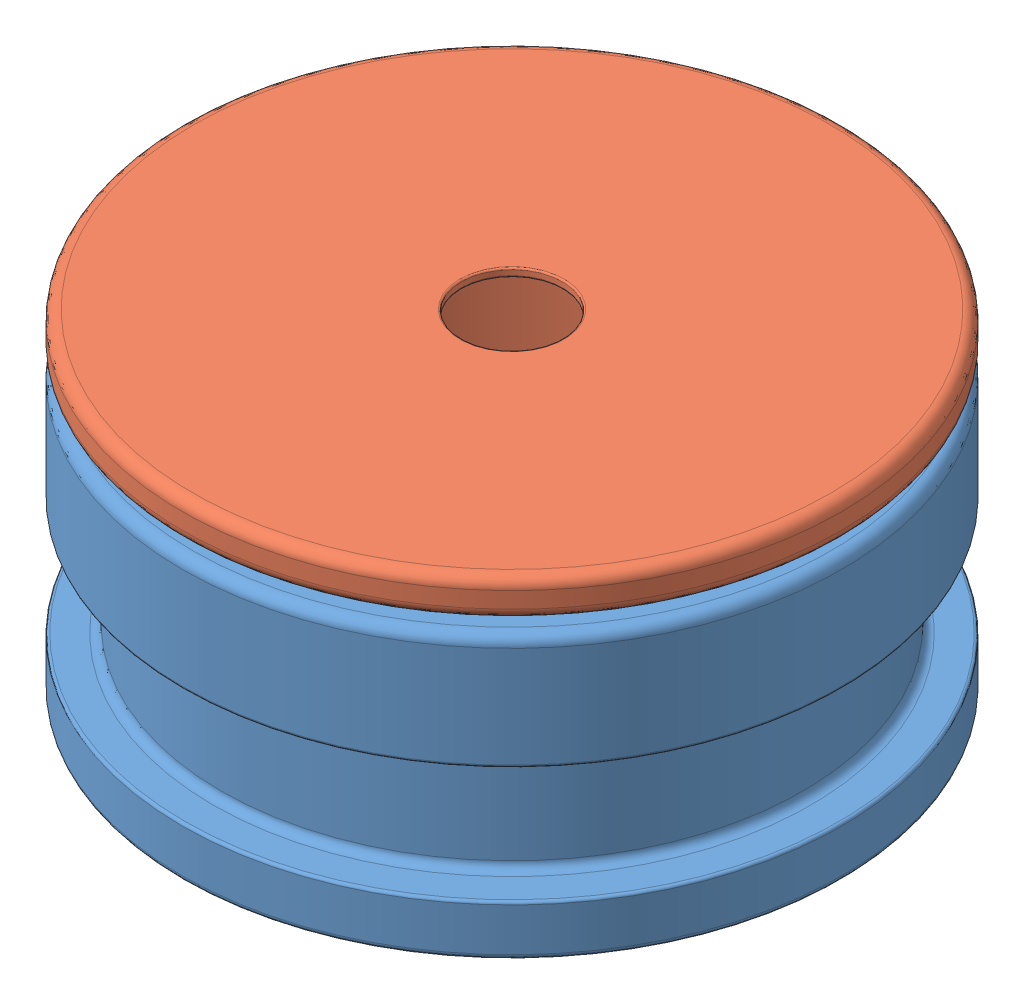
SolidWorks assembly SH1.SLDASM, configuration Default (file format 4400). Lengths in mm.
Overall size (35.54 15.65 35.54).
6 component instances, 6 part files, 9 mates.
Components (placement in the parent):
- SH1 Bottom-1: SH1 Bottom.SLDPRT [Default] at origin size (31.12 13.28 31.12)
- SH1 Top-1: SH1 Top.SLDPRT [Default] at (0 2.3622 0) size (31.12 13.08 31.12)
- 1002432-001-1: 1002432-001.SLDPRT [Default] at (0 -11.1498 0) x (0.73007 0 -0.683372) z (0 1 0) size (25.15 25.15 0.38)
- 25 mm filter-1: 25 mm filter.SLDPRT [Default] at (0 -10.7688 0) x (0.981263 0 0.192671) z (0 1 0) size (25 25 0.05)
- 021oring-4: 021oring.SLDPRT [PreviewCfg] at (0 -2.7432 0) size (28.19 1.78 28.19)
- 020oring-3: 020oring.SLDPRT [PreviewCfg] at (0 -7.0192 0) x (0.863465 0 -0.504409) z (0.504409 0 0.863465) size (25.78 1.78 25.78)
Mates (geometry in assembly coordinates):
- Concentric1: concentric aligned: cylinder of SH1 Bottom-1 through (0 0 0) axis (0 1 0) radius 15.5575; cylinder of SH1 Top-1 through (0 2.3622 0) axis (0 1 0) radius 15.5575
- Distance1: distance = 0.5842 mm anti-aligned: plane of SH1 Bottom-1 through (-14.138 0 0) normal (0 1 0); plane of SH1 Top-1 through (-15.0495 0.5842 0) normal (0 -1 0)
- Coincident1: coincident anti-aligned: plane of 1002432-001-1 through (-0.5931 -10.7688 17.9507) normal (0 1 0); plane of 25 mm filter-1 through (0 -10.7688 0) normal (0 -1 0)
- Concentric2: concentric aligned: cylinder of 1002432-001-1 through (0 -10.7688 0) axis (0 -1 0) radius 12.573; cylinder of 25 mm filter-1 through (0 -10.7188 0) axis (0 -1 0) radius 12.5
- Concentric3: concentric anti-aligned: cylinder of SH1 Bottom-1 through (0 0 0) axis (0 1 0) radius 12.7; cylinder of 1002432-001-1 through (0 -10.7688 0) axis (0 -1 0) radius 12.573
- Coincident2: coincident anti-aligned: plane of SH1 Top-1 through (-12.4206 -10.7188 0) normal (0 -1 0); plane of 25 mm filter-1 through (0 -10.7188 0) normal (0 1 0)
- Concentric4: concentric anti-aligned: cylinder of SH1 Top-1 through (0 2.3622 0) axis (0 1 0) radius 10.541; axis of 021oring-4 through (0 5.2392 0) axis (0 -1 0)
- Concentric6: concentric anti-aligned: cylinder of SH1 Top-1 through (0 2.3622 0) axis (0 1 0) radius 10.541; axis of 020oring-3 through (0 0.2814 0) axis (0 -1 0)
- Tangent1: tangent: face of 021oring-4; plane of SH1 Top-1 through (-13.208 -3.6322 0) normal (0 1 0); plane of assembly; plane of assembly; plane of assembly
